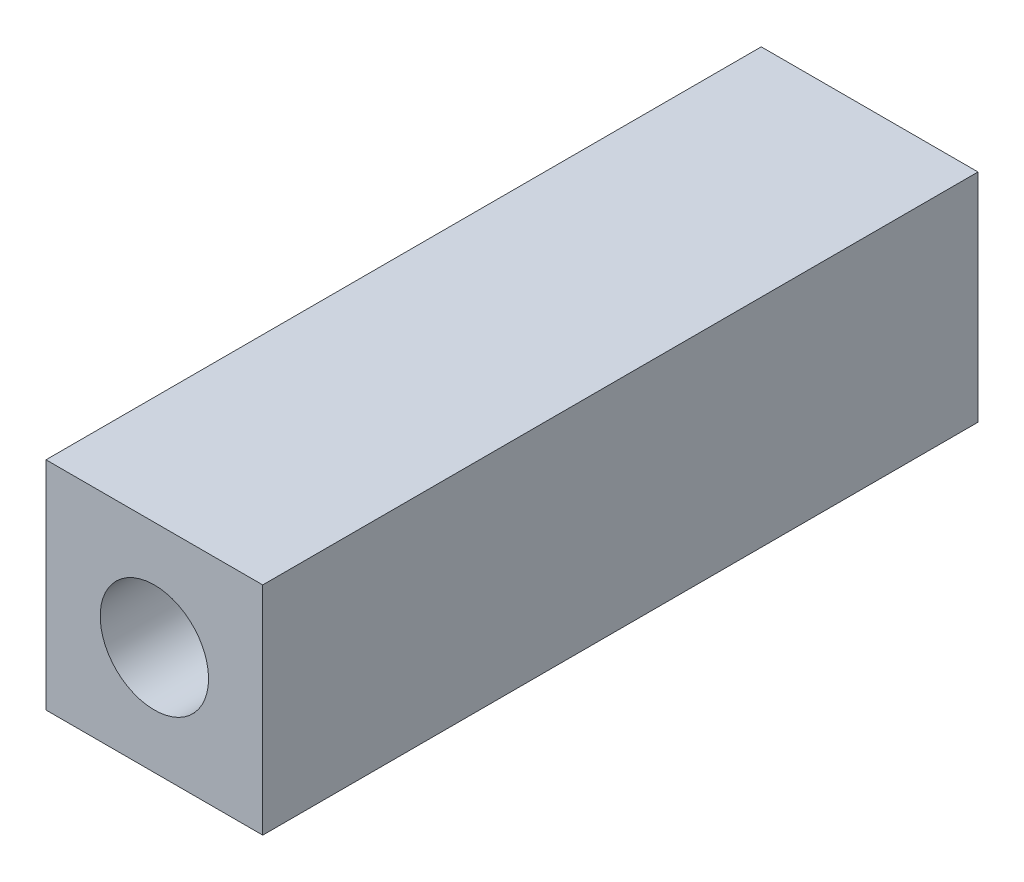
ISO-10303-21;
HEADER;
FILE_DESCRIPTION(('STEP AP214'),'2;1');
FILE_NAME('part.step','',(''),(''),'','','');
FILE_SCHEMA(('AUTOMOTIVE_DESIGN { 1 0 10303 214 1 1 1 1 }'));
ENDSEC;
DATA;
#1=APPLICATION_CONTEXT('core data for automotive mechanical design processes');
#2=APPLICATION_PROTOCOL_DEFINITION('international standard','automotive_design',2000,#1);
#3=PRODUCT_CONTEXT('',#1,'mechanical');
#4=PRODUCT('Part','Part','',(#3));
#5=PRODUCT_RELATED_PRODUCT_CATEGORY('part','',(#4));
#6=PRODUCT_DEFINITION_FORMATION('','',#4);
#7=PRODUCT_DEFINITION_CONTEXT('part definition',#1,'design');
#8=PRODUCT_DEFINITION('design','',#6,#7);
#9=PRODUCT_DEFINITION_SHAPE('','',#8);
#10=(LENGTH_UNIT() NAMED_UNIT(*) SI_UNIT(.MILLI.,.METRE.));
#11=(NAMED_UNIT(*) PLANE_ANGLE_UNIT() SI_UNIT($,.RADIAN.));
#12=(NAMED_UNIT(*) SI_UNIT($,.STERADIAN.) SOLID_ANGLE_UNIT());
#13=UNCERTAINTY_MEASURE_WITH_UNIT(LENGTH_MEASURE(1.E-05),#10,'distance_accuracy_value','');
#14=(GEOMETRIC_REPRESENTATION_CONTEXT(3) GLOBAL_UNCERTAINTY_ASSIGNED_CONTEXT((#13)) GLOBAL_UNIT_ASSIGNED_CONTEXT((#10,
#11,#12)) REPRESENTATION_CONTEXT('',''));
#15=CARTESIAN_POINT('',(0.,0.,0.));
#16=DIRECTION('',(0.,0.,1.));
#17=DIRECTION('',(1.,0.,0.));
#18=AXIS2_PLACEMENT_3D('',#15,#16,#17);
#19=CARTESIAN_POINT('',(0.,0.,41.91));
#20=DIRECTION('',(0.,0.,1.));
#21=DIRECTION('',(1.,0.,0.));
#22=AXIS2_PLACEMENT_3D('',#19,#20,#21);
#23=PLANE('',#22);
#24=DIRECTION('',(0.,1.,0.));
#25=VECTOR('',#24,1.);
#26=CARTESIAN_POINT('',(6.35,-6.35,41.91));
#27=LINE('',#26,#25);
#28=CARTESIAN_POINT('',(6.35,-6.35,41.91));
#29=VERTEX_POINT('',#28);
#30=CARTESIAN_POINT('',(6.35,6.35,41.91));
#31=VERTEX_POINT('',#30);
#32=EDGE_CURVE('E100',#29,#31,#27,.T.);
#33=ORIENTED_EDGE('',*,*,#32,.T.);
#34=DIRECTION('',(-1.,0.,0.));
#35=VECTOR('',#34,1.);
#36=CARTESIAN_POINT('',(6.35,6.35,41.91));
#37=LINE('',#36,#35);
#38=CARTESIAN_POINT('',(-6.35,6.35,41.91));
#39=VERTEX_POINT('',#38);
#40=EDGE_CURVE('E92',#31,#39,#37,.T.);
#41=ORIENTED_EDGE('',*,*,#40,.T.);
#42=DIRECTION('',(0.,1.,0.));
#43=VECTOR('',#42,1.);
#44=CARTESIAN_POINT('',(-6.35,-6.35,41.91));
#45=LINE('',#44,#43);
#46=CARTESIAN_POINT('',(-6.35,-6.35,41.91));
#47=VERTEX_POINT('',#46);
#48=EDGE_CURVE('E99',#47,#39,#45,.T.);
#49=ORIENTED_EDGE('',*,*,#48,.F.);
#50=DIRECTION('',(-1.,0.,0.));
#51=VECTOR('',#50,1.);
#52=CARTESIAN_POINT('',(6.35,-6.35,41.91));
#53=LINE('',#52,#51);
#54=EDGE_CURVE('E109',#29,#47,#53,.T.);
#55=ORIENTED_EDGE('',*,*,#54,.F.);
#56=EDGE_LOOP('',(#33,#41,#49,#55));
#57=FACE_BOUND('',#56,.T.);
#58=CARTESIAN_POINT('',(0.,0.,41.91));
#59=DIRECTION('',(0.,0.,1.));
#60=DIRECTION('',(1.,0.,0.));
#61=AXIS2_PLACEMENT_3D('',#58,#59,#60);
#62=CIRCLE('',#61,3.175);
#63=CARTESIAN_POINT('',(3.175,0.,41.91));
#64=VERTEX_POINT('',#63);
#65=EDGE_CURVE('E116',#64,#64,#62,.T.);
#66=ORIENTED_EDGE('',*,*,#65,.F.);
#67=EDGE_LOOP('',(#66));
#68=FACE_BOUND('',#67,.T.);
#69=ADVANCED_FACE('F50',(#57,#68),#23,.T.);
#70=CARTESIAN_POINT('',(0.,0.,0.));
#71=DIRECTION('',(0.,0.,1.));
#72=DIRECTION('',(1.,0.,0.));
#73=AXIS2_PLACEMENT_3D('',#70,#71,#72);
#74=PLANE('',#73);
#75=DIRECTION('',(0.,1.,0.));
#76=VECTOR('',#75,1.);
#77=CARTESIAN_POINT('',(6.35,-6.35,0.));
#78=LINE('',#77,#76);
#79=CARTESIAN_POINT('',(6.35,-6.35,0.));
#80=VERTEX_POINT('',#79);
#81=CARTESIAN_POINT('',(6.35,6.35,0.));
#82=VERTEX_POINT('',#81);
#83=EDGE_CURVE('E114',#80,#82,#78,.T.);
#84=ORIENTED_EDGE('',*,*,#83,.F.);
#85=DIRECTION('',(-1.,0.,0.));
#86=VECTOR('',#85,1.);
#87=CARTESIAN_POINT('',(6.35,-6.35,0.));
#88=LINE('',#87,#86);
#89=CARTESIAN_POINT('',(-6.35,-6.35,0.));
#90=VERTEX_POINT('',#89);
#91=EDGE_CURVE('E120',#80,#90,#88,.T.);
#92=ORIENTED_EDGE('',*,*,#91,.T.);
#93=DIRECTION('',(0.,1.,0.));
#94=VECTOR('',#93,1.);
#95=CARTESIAN_POINT('',(-6.35,-6.35,0.));
#96=LINE('',#95,#94);
#97=CARTESIAN_POINT('',(-6.35,6.35,0.));
#98=VERTEX_POINT('',#97);
#99=EDGE_CURVE('E118',#90,#98,#96,.T.);
#100=ORIENTED_EDGE('',*,*,#99,.T.);
#101=DIRECTION('',(-1.,0.,0.));
#102=VECTOR('',#101,1.);
#103=CARTESIAN_POINT('',(6.35,6.35,0.));
#104=LINE('',#103,#102);
#105=EDGE_CURVE('E105',#82,#98,#104,.T.);
#106=ORIENTED_EDGE('',*,*,#105,.F.);
#107=EDGE_LOOP('',(#84,#92,#100,#106));
#108=FACE_BOUND('',#107,.T.);
#109=CARTESIAN_POINT('',(0.,0.,0.));
#110=DIRECTION('',(0.,0.,1.));
#111=DIRECTION('',(1.,0.,0.));
#112=AXIS2_PLACEMENT_3D('',#109,#110,#111);
#113=CIRCLE('',#112,3.175);
#114=CARTESIAN_POINT('',(3.175,0.,0.));
#115=VERTEX_POINT('',#114);
#116=EDGE_CURVE('E126',#115,#115,#113,.T.);
#117=ORIENTED_EDGE('',*,*,#116,.T.);
#118=EDGE_LOOP('',(#117));
#119=FACE_BOUND('',#118,.T.);
#120=ADVANCED_FACE('F135',(#108,#119),#74,.F.);
#121=CARTESIAN_POINT('',(6.35,-6.35,41.91));
#122=DIRECTION('',(-1.,0.,0.));
#123=DIRECTION('',(0.,0.,1.));
#124=AXIS2_PLACEMENT_3D('',#121,#122,#123);
#125=PLANE('',#124);
#126=ORIENTED_EDGE('',*,*,#83,.T.);
#127=DIRECTION('',(0.,0.,-1.));
#128=VECTOR('',#127,1.);
#129=CARTESIAN_POINT('',(6.35,6.35,41.91));
#130=LINE('',#129,#128);
#131=EDGE_CURVE('E12',#31,#82,#130,.T.);
#132=ORIENTED_EDGE('',*,*,#131,.F.);
#133=ORIENTED_EDGE('',*,*,#32,.F.);
#134=DIRECTION('',(0.,0.,-1.));
#135=VECTOR('',#134,1.);
#136=CARTESIAN_POINT('',(6.35,-6.35,41.91));
#137=LINE('',#136,#135);
#138=EDGE_CURVE('E67',#29,#80,#137,.T.);
#139=ORIENTED_EDGE('',*,*,#138,.T.);
#140=EDGE_LOOP('',(#126,#132,#133,#139));
#141=FACE_BOUND('',#140,.T.);
#142=ADVANCED_FACE('F52',(#141),#125,.F.);
#143=CARTESIAN_POINT('',(6.35,6.35,41.91));
#144=DIRECTION('',(0.,-1.,0.));
#145=DIRECTION('',(1.,0.,0.));
#146=AXIS2_PLACEMENT_3D('',#143,#144,#145);
#147=PLANE('',#146);
#148=ORIENTED_EDGE('',*,*,#105,.T.);
#149=DIRECTION('',(0.,0.,-1.));
#150=VECTOR('',#149,1.);
#151=CARTESIAN_POINT('',(-6.35,6.35,41.91));
#152=LINE('',#151,#150);
#153=EDGE_CURVE('E59',#39,#98,#152,.T.);
#154=ORIENTED_EDGE('',*,*,#153,.F.);
#155=ORIENTED_EDGE('',*,*,#40,.F.);
#156=ORIENTED_EDGE('',*,*,#131,.T.);
#157=EDGE_LOOP('',(#148,#154,#155,#156));
#158=FACE_BOUND('',#157,.T.);
#159=ADVANCED_FACE('F104',(#158),#147,.F.);
#160=CARTESIAN_POINT('',(-6.35,-6.35,41.91));
#161=DIRECTION('',(-1.,0.,0.));
#162=DIRECTION('',(0.,0.,1.));
#163=AXIS2_PLACEMENT_3D('',#160,#161,#162);
#164=PLANE('',#163);
#165=ORIENTED_EDGE('',*,*,#99,.F.);
#166=DIRECTION('',(0.,0.,-1.));
#167=VECTOR('',#166,1.);
#168=CARTESIAN_POINT('',(-6.35,-6.35,41.91));
#169=LINE('',#168,#167);
#170=EDGE_CURVE('E81',#47,#90,#169,.T.);
#171=ORIENTED_EDGE('',*,*,#170,.F.);
#172=ORIENTED_EDGE('',*,*,#48,.T.);
#173=ORIENTED_EDGE('',*,*,#153,.T.);
#174=EDGE_LOOP('',(#165,#171,#172,#173));
#175=FACE_BOUND('',#174,.T.);
#176=ADVANCED_FACE('F108',(#175),#164,.T.);
#177=CARTESIAN_POINT('',(6.35,-6.35,41.91));
#178=DIRECTION('',(0.,-1.,0.));
#179=DIRECTION('',(1.,0.,0.));
#180=AXIS2_PLACEMENT_3D('',#177,#178,#179);
#181=PLANE('',#180);
#182=ORIENTED_EDGE('',*,*,#91,.F.);
#183=ORIENTED_EDGE('',*,*,#138,.F.);
#184=ORIENTED_EDGE('',*,*,#54,.T.);
#185=ORIENTED_EDGE('',*,*,#170,.T.);
#186=EDGE_LOOP('',(#182,#183,#184,#185));
#187=FACE_BOUND('',#186,.T.);
#188=ADVANCED_FACE('F143',(#187),#181,.T.);
#189=CARTESIAN_POINT('',(0.,0.,41.91));
#190=DIRECTION('',(0.,0.,-1.));
#191=DIRECTION('',(-1.,0.,0.));
#192=AXIS2_PLACEMENT_3D('',#189,#190,#191);
#193=CYLINDRICAL_SURFACE('',#192,3.175);
#194=ORIENTED_EDGE('',*,*,#65,.T.);
#195=EDGE_LOOP('',(#194));
#196=FACE_BOUND('',#195,.T.);
#197=ORIENTED_EDGE('',*,*,#116,.F.);
#198=EDGE_LOOP('',(#197));
#199=FACE_BOUND('',#198,.T.);
#200=ADVANCED_FACE('F132',(#196,#199),#193,.F.);
#201=CLOSED_SHELL('',(#69,#120,#142,#159,#176,#188,#200));
#202=MANIFOLD_SOLID_BREP('B2',#201);
#203=ADVANCED_BREP_SHAPE_REPRESENTATION('',(#18,#202),#14);
#204=SHAPE_DEFINITION_REPRESENTATION(#9,#203);
ENDSEC;
END-ISO-10303-21;
